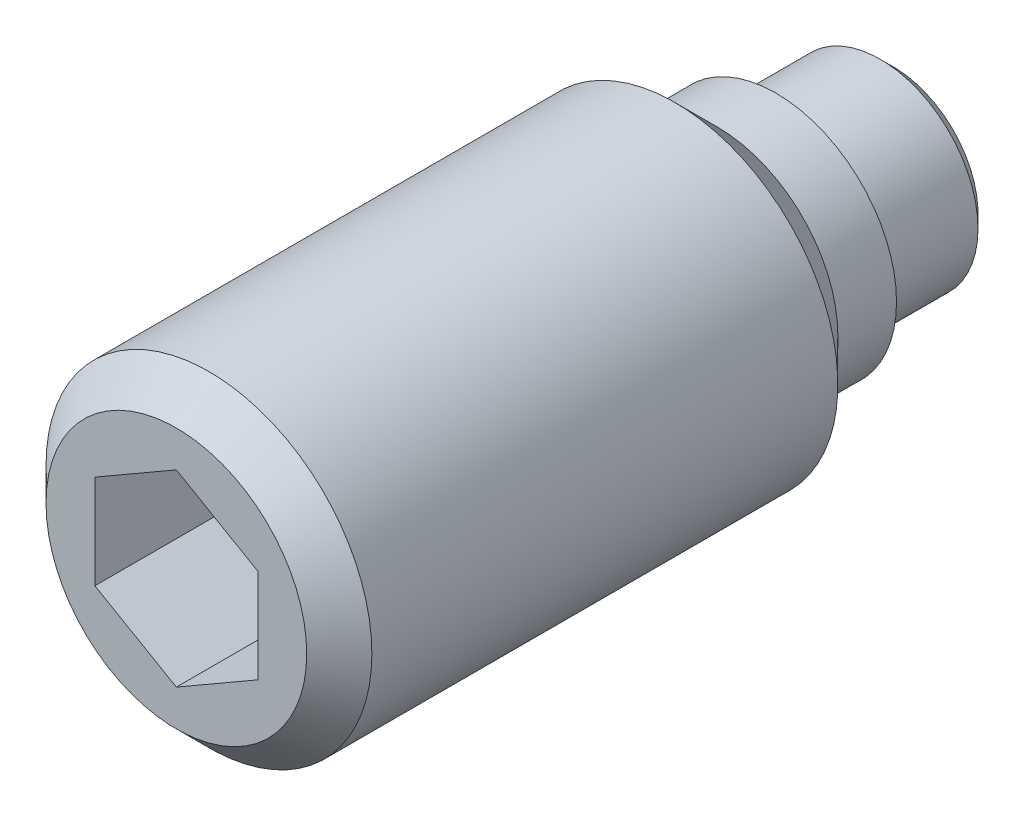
ISO-10303-21;
HEADER;
FILE_DESCRIPTION(('STEP AP214'),'2;1');
FILE_NAME('part.step','',(''),(''),'','','');
FILE_SCHEMA(('AUTOMOTIVE_DESIGN { 1 0 10303 214 1 1 1 1 }'));
ENDSEC;
DATA;
#1=APPLICATION_CONTEXT('core data for automotive mechanical design processes');
#2=APPLICATION_PROTOCOL_DEFINITION('international standard','automotive_design',2000,#1);
#3=PRODUCT_CONTEXT('',#1,'mechanical');
#4=PRODUCT('Part','Part','',(#3));
#5=PRODUCT_RELATED_PRODUCT_CATEGORY('part','',(#4));
#6=PRODUCT_DEFINITION_FORMATION('','',#4);
#7=PRODUCT_DEFINITION_CONTEXT('part definition',#1,'design');
#8=PRODUCT_DEFINITION('design','',#6,#7);
#9=PRODUCT_DEFINITION_SHAPE('','',#8);
#10=(LENGTH_UNIT() NAMED_UNIT(*) SI_UNIT(.MILLI.,.METRE.));
#11=(NAMED_UNIT(*) PLANE_ANGLE_UNIT() SI_UNIT($,.RADIAN.));
#12=(NAMED_UNIT(*) SI_UNIT($,.STERADIAN.) SOLID_ANGLE_UNIT());
#13=UNCERTAINTY_MEASURE_WITH_UNIT(LENGTH_MEASURE(1.E-05),#10,'distance_accuracy_value','');
#14=(GEOMETRIC_REPRESENTATION_CONTEXT(3) GLOBAL_UNCERTAINTY_ASSIGNED_CONTEXT((#13)) GLOBAL_UNIT_ASSIGNED_CONTEXT((#10,
#11,#12)) REPRESENTATION_CONTEXT('',''));
#15=CARTESIAN_POINT('',(0.,0.,0.));
#16=DIRECTION('',(0.,0.,1.));
#17=DIRECTION('',(1.,0.,0.));
#18=AXIS2_PLACEMENT_3D('',#15,#16,#17);
#19=CARTESIAN_POINT('',(0.,0.,1.8));
#20=DIRECTION('',(0.,0.,-1.));
#21=DIRECTION('',(-1.,0.,0.));
#22=AXIS2_PLACEMENT_3D('',#19,#20,#21);
#23=CYLINDRICAL_SURFACE('',#22,2.5);
#24=CARTESIAN_POINT('',(0.,0.,3.35));
#25=DIRECTION('',(0.,0.,-1.));
#26=DIRECTION('',(-1.,0.,0.));
#27=AXIS2_PLACEMENT_3D('',#24,#25,#26);
#28=CIRCLE('',#27,2.5);
#29=CARTESIAN_POINT('',(-2.5,0.,3.35));
#30=VERTEX_POINT('',#29);
#31=EDGE_CURVE('E9',#30,#30,#28,.T.);
#32=ORIENTED_EDGE('',*,*,#31,.F.);
#33=EDGE_LOOP('',(#32));
#34=FACE_BOUND('',#33,.T.);
#35=CARTESIAN_POINT('',(0.,0.,10.5));
#36=DIRECTION('',(0.,0.,1.));
#37=DIRECTION('',(1.,0.,0.));
#38=AXIS2_PLACEMENT_3D('',#35,#36,#37);
#39=CIRCLE('',#38,2.5);
#40=CARTESIAN_POINT('',(2.5,0.,10.5));
#41=VERTEX_POINT('',#40);
#42=EDGE_CURVE('E123',#41,#41,#39,.T.);
#43=ORIENTED_EDGE('',*,*,#42,.F.);
#44=EDGE_LOOP('',(#43));
#45=FACE_BOUND('',#44,.T.);
#46=ADVANCED_FACE('F14',(#34,#45),#23,.T.);
#47=CARTESIAN_POINT('',(0.,0.,3.35));
#48=DIRECTION('',(0.,0.,1.));
#49=DIRECTION('',(1.,0.,0.));
#50=AXIS2_PLACEMENT_3D('',#47,#48,#49);
#51=CONICAL_SURFACE('',#50,2.5,0.785398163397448);
#52=ORIENTED_EDGE('',*,*,#31,.T.);
#53=EDGE_LOOP('',(#52));
#54=FACE_BOUND('',#53,.T.);
#55=CARTESIAN_POINT('',(0.,0.,2.7));
#56=DIRECTION('',(0.,0.,-1.));
#57=DIRECTION('',(-1.,0.,0.));
#58=AXIS2_PLACEMENT_3D('',#55,#56,#57);
#59=CIRCLE('',#58,1.85);
#60=CARTESIAN_POINT('',(-1.85,0.,2.7));
#61=VERTEX_POINT('',#60);
#62=EDGE_CURVE('E21',#61,#61,#59,.T.);
#63=ORIENTED_EDGE('',*,*,#62,.F.);
#64=EDGE_LOOP('',(#63));
#65=FACE_BOUND('',#64,.T.);
#66=ADVANCED_FACE('F143',(#54,#65),#51,.T.);
#67=CARTESIAN_POINT('',(0.,0.,1.8));
#68=DIRECTION('',(0.,0.,-1.));
#69=DIRECTION('',(-1.,0.,0.));
#70=AXIS2_PLACEMENT_3D('',#67,#68,#69);
#71=CYLINDRICAL_SURFACE('',#70,1.85);
#72=ORIENTED_EDGE('',*,*,#62,.T.);
#73=EDGE_LOOP('',(#72));
#74=FACE_BOUND('',#73,.T.);
#75=CARTESIAN_POINT('',(0.,0.,1.8));
#76=DIRECTION('',(0.,0.,-1.));
#77=DIRECTION('',(-1.,0.,0.));
#78=AXIS2_PLACEMENT_3D('',#75,#76,#77);
#79=CIRCLE('',#78,1.85);
#80=CARTESIAN_POINT('',(-1.85,0.,1.8));
#81=VERTEX_POINT('',#80);
#82=EDGE_CURVE('E135',#81,#81,#79,.T.);
#83=ORIENTED_EDGE('',*,*,#82,.F.);
#84=EDGE_LOOP('',(#83));
#85=FACE_BOUND('',#84,.T.);
#86=ADVANCED_FACE('F140',(#74,#85),#71,.T.);
#87=CARTESIAN_POINT('',(0.,1.85,1.8));
#88=DIRECTION('',(0.,0.,1.));
#89=DIRECTION('',(1.,0.,0.));
#90=AXIS2_PLACEMENT_3D('',#87,#88,#89);
#91=PLANE('',#90);
#92=ORIENTED_EDGE('',*,*,#82,.T.);
#93=EDGE_LOOP('',(#92));
#94=FACE_BOUND('',#93,.T.);
#95=CARTESIAN_POINT('',(0.,0.,1.8));
#96=DIRECTION('',(0.,0.,-1.));
#97=DIRECTION('',(-1.,0.,0.));
#98=AXIS2_PLACEMENT_3D('',#95,#96,#97);
#99=CIRCLE('',#98,1.5);
#100=CARTESIAN_POINT('',(-1.5,0.,1.8));
#101=VERTEX_POINT('',#100);
#102=EDGE_CURVE('E132',#101,#101,#99,.T.);
#103=ORIENTED_EDGE('',*,*,#102,.F.);
#104=EDGE_LOOP('',(#103));
#105=FACE_BOUND('',#104,.T.);
#106=ADVANCED_FACE('F151',(#94,#105),#91,.F.);
#107=CARTESIAN_POINT('',(0.,0.,0.));
#108=DIRECTION('',(0.,0.,-1.));
#109=DIRECTION('',(-1.,0.,0.));
#110=AXIS2_PLACEMENT_3D('',#107,#108,#109);
#111=CYLINDRICAL_SURFACE('',#110,1.5);
#112=CARTESIAN_POINT('',(0.,0.,0.2));
#113=DIRECTION('',(0.,0.,-1.));
#114=DIRECTION('',(-1.,0.,0.));
#115=AXIS2_PLACEMENT_3D('',#112,#113,#114);
#116=CIRCLE('',#115,1.5);
#117=CARTESIAN_POINT('',(-1.5,0.,0.2));
#118=VERTEX_POINT('',#117);
#119=EDGE_CURVE('E129',#118,#118,#116,.T.);
#120=ORIENTED_EDGE('',*,*,#119,.F.);
#121=EDGE_LOOP('',(#120));
#122=FACE_BOUND('',#121,.T.);
#123=ORIENTED_EDGE('',*,*,#102,.T.);
#124=EDGE_LOOP('',(#123));
#125=FACE_BOUND('',#124,.T.);
#126=ADVANCED_FACE('F157',(#122,#125),#111,.T.);
#127=CARTESIAN_POINT('',(0.,0.,0.2));
#128=DIRECTION('',(0.,0.,1.));
#129=DIRECTION('',(1.,0.,0.));
#130=AXIS2_PLACEMENT_3D('',#127,#128,#129);
#131=CONICAL_SURFACE('',#130,1.5,0.785398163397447);
#132=CARTESIAN_POINT('',(0.,0.,0.));
#133=DIRECTION('',(0.,0.,-1.));
#134=DIRECTION('',(-1.,0.,0.));
#135=AXIS2_PLACEMENT_3D('',#132,#133,#134);
#136=CIRCLE('',#135,1.3);
#137=CARTESIAN_POINT('',(-1.3,0.,0.));
#138=VERTEX_POINT('',#137);
#139=EDGE_CURVE('E126',#138,#138,#136,.T.);
#140=ORIENTED_EDGE('',*,*,#139,.F.);
#141=EDGE_LOOP('',(#140));
#142=FACE_BOUND('',#141,.T.);
#143=ORIENTED_EDGE('',*,*,#119,.T.);
#144=EDGE_LOOP('',(#143));
#145=FACE_BOUND('',#144,.T.);
#146=ADVANCED_FACE('F161',(#142,#145),#131,.T.);
#147=CARTESIAN_POINT('',(0.,1.3,0.));
#148=DIRECTION('',(0.,0.,1.));
#149=DIRECTION('',(1.,0.,0.));
#150=AXIS2_PLACEMENT_3D('',#147,#148,#149);
#151=PLANE('',#150);
#152=ORIENTED_EDGE('',*,*,#139,.T.);
#153=EDGE_LOOP('',(#152));
#154=FACE_BOUND('',#153,.T.);
#155=ADVANCED_FACE('F165',(#154),#151,.F.);
#156=CARTESIAN_POINT('',(0.,0.,11.));
#157=DIRECTION('',(0.,0.,-1.));
#158=DIRECTION('',(-1.,0.,0.));
#159=AXIS2_PLACEMENT_3D('',#156,#157,#158);
#160=CONICAL_SURFACE('',#159,2.,0.785398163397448);
#161=ORIENTED_EDGE('',*,*,#42,.T.);
#162=EDGE_LOOP('',(#161));
#163=FACE_BOUND('',#162,.T.);
#164=CARTESIAN_POINT('',(0.,0.,11.));
#165=DIRECTION('',(0.,0.,1.));
#166=DIRECTION('',(1.,0.,0.));
#167=AXIS2_PLACEMENT_3D('',#164,#165,#166);
#168=CIRCLE('',#167,2.);
#169=CARTESIAN_POINT('',(2.,0.,11.));
#170=VERTEX_POINT('',#169);
#171=EDGE_CURVE('E115',#170,#170,#168,.T.);
#172=ORIENTED_EDGE('',*,*,#171,.F.);
#173=EDGE_LOOP('',(#172));
#174=FACE_BOUND('',#173,.T.);
#175=ADVANCED_FACE('F169',(#163,#174),#160,.T.);
#176=CARTESIAN_POINT('',(0.,-2.,11.));
#177=DIRECTION('',(0.,0.,1.));
#178=DIRECTION('',(1.,0.,0.));
#179=AXIS2_PLACEMENT_3D('',#176,#177,#178);
#180=PLANE('',#179);
#181=DIRECTION('',(0.866025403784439,-0.5,0.));
#182=VECTOR('',#181,1.);
#183=CARTESIAN_POINT('',(-1.25,-0.721687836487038,11.));
#184=LINE('',#183,#182);
#185=CARTESIAN_POINT('',(-1.25,-0.721687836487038,11.));
#186=VERTEX_POINT('',#185);
#187=CARTESIAN_POINT('',(0.,-1.44337567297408,11.));
#188=VERTEX_POINT('',#187);
#189=EDGE_CURVE('E28',#186,#188,#184,.T.);
#190=ORIENTED_EDGE('',*,*,#189,.F.);
#191=DIRECTION('',(0.,-1.,0.));
#192=VECTOR('',#191,1.);
#193=CARTESIAN_POINT('',(-1.25,0.721687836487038,11.));
#194=LINE('',#193,#192);
#195=CARTESIAN_POINT('',(-1.25,0.721687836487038,11.));
#196=VERTEX_POINT('',#195);
#197=EDGE_CURVE('E111',#196,#186,#194,.T.);
#198=ORIENTED_EDGE('',*,*,#197,.F.);
#199=DIRECTION('',(-0.866025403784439,-0.5,0.));
#200=VECTOR('',#199,1.);
#201=CARTESIAN_POINT('',(0.,1.44337567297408,11.));
#202=LINE('',#201,#200);
#203=CARTESIAN_POINT('',(0.,1.44337567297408,11.));
#204=VERTEX_POINT('',#203);
#205=EDGE_CURVE('E109',#204,#196,#202,.T.);
#206=ORIENTED_EDGE('',*,*,#205,.F.);
#207=DIRECTION('',(-0.866025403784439,0.5,0.));
#208=VECTOR('',#207,1.);
#209=CARTESIAN_POINT('',(1.25,0.721687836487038,11.));
#210=LINE('',#209,#208);
#211=CARTESIAN_POINT('',(1.25,0.721687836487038,11.));
#212=VERTEX_POINT('',#211);
#213=EDGE_CURVE('E76',#212,#204,#210,.T.);
#214=ORIENTED_EDGE('',*,*,#213,.F.);
#215=DIRECTION('',(0.,1.,0.));
#216=VECTOR('',#215,1.);
#217=CARTESIAN_POINT('',(1.25,-0.721687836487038,11.));
#218=LINE('',#217,#216);
#219=CARTESIAN_POINT('',(1.25,-0.721687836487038,11.));
#220=VERTEX_POINT('',#219);
#221=EDGE_CURVE('E105',#220,#212,#218,.T.);
#222=ORIENTED_EDGE('',*,*,#221,.F.);
#223=DIRECTION('',(0.866025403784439,0.5,0.));
#224=VECTOR('',#223,1.);
#225=CARTESIAN_POINT('',(0.,-1.44337567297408,11.));
#226=LINE('',#225,#224);
#227=EDGE_CURVE('E102',#188,#220,#226,.T.);
#228=ORIENTED_EDGE('',*,*,#227,.F.);
#229=EDGE_LOOP('',(#190,#198,#206,#214,#222,#228));
#230=FACE_BOUND('',#229,.T.);
#231=ORIENTED_EDGE('',*,*,#171,.T.);
#232=EDGE_LOOP('',(#231));
#233=FACE_BOUND('',#232,.T.);
#234=ADVANCED_FACE('F173',(#230,#233),#180,.T.);
#235=CARTESIAN_POINT('',(-1.25,-0.721687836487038,8.));
#236=DIRECTION('',(-0.5,-0.866025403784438,0.));
#237=DIRECTION('',(0.866025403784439,-0.5,0.));
#238=AXIS2_PLACEMENT_3D('',#235,#236,#237);
#239=PLANE('',#238);
#240=ORIENTED_EDGE('',*,*,#189,.T.);
#241=DIRECTION('',(0.,0.,1.));
#242=VECTOR('',#241,1.);
#243=CARTESIAN_POINT('',(0.,-1.44337567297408,8.));
#244=LINE('',#243,#242);
#245=CARTESIAN_POINT('',(0.,-1.44337567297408,8.));
#246=VERTEX_POINT('',#245);
#247=EDGE_CURVE('E58',#246,#188,#244,.T.);
#248=ORIENTED_EDGE('',*,*,#247,.F.);
#249=DIRECTION('',(0.866025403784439,-0.5,0.));
#250=VECTOR('',#249,1.);
#251=CARTESIAN_POINT('',(-1.25,-0.721687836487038,8.));
#252=LINE('',#251,#250);
#253=CARTESIAN_POINT('',(-1.25,-0.721687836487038,8.));
#254=VERTEX_POINT('',#253);
#255=EDGE_CURVE('E113',#254,#246,#252,.T.);
#256=ORIENTED_EDGE('',*,*,#255,.F.);
#257=DIRECTION('',(0.,0.,1.));
#258=VECTOR('',#257,1.);
#259=CARTESIAN_POINT('',(-1.25,-0.721687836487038,8.));
#260=LINE('',#259,#258);
#261=EDGE_CURVE('E36',#254,#186,#260,.T.);
#262=ORIENTED_EDGE('',*,*,#261,.T.);
#263=EDGE_LOOP('',(#240,#248,#256,#262));
#264=FACE_BOUND('',#263,.T.);
#265=ADVANCED_FACE('F177',(#264),#239,.F.);
#266=CARTESIAN_POINT('',(-1.25,0.721687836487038,8.));
#267=DIRECTION('',(-1.,0.,0.));
#268=DIRECTION('',(0.,0.,1.));
#269=AXIS2_PLACEMENT_3D('',#266,#267,#268);
#270=PLANE('',#269);
#271=ORIENTED_EDGE('',*,*,#197,.T.);
#272=ORIENTED_EDGE('',*,*,#261,.F.);
#273=DIRECTION('',(0.,-1.,0.));
#274=VECTOR('',#273,1.);
#275=CARTESIAN_POINT('',(-1.25,0.721687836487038,8.));
#276=LINE('',#275,#274);
#277=CARTESIAN_POINT('',(-1.25,0.721687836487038,8.));
#278=VERTEX_POINT('',#277);
#279=EDGE_CURVE('E88',#278,#254,#276,.T.);
#280=ORIENTED_EDGE('',*,*,#279,.F.);
#281=DIRECTION('',(0.,0.,1.));
#282=VECTOR('',#281,1.);
#283=CARTESIAN_POINT('',(-1.25,0.721687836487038,8.));
#284=LINE('',#283,#282);
#285=EDGE_CURVE('E80',#278,#196,#284,.T.);
#286=ORIENTED_EDGE('',*,*,#285,.T.);
#287=EDGE_LOOP('',(#271,#272,#280,#286));
#288=FACE_BOUND('',#287,.T.);
#289=ADVANCED_FACE('F181',(#288),#270,.F.);
#290=CARTESIAN_POINT('',(0.,1.44337567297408,8.));
#291=DIRECTION('',(-0.5,0.866025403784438,0.));
#292=DIRECTION('',(-0.866025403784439,-0.5,0.));
#293=AXIS2_PLACEMENT_3D('',#290,#291,#292);
#294=PLANE('',#293);
#295=ORIENTED_EDGE('',*,*,#205,.T.);
#296=ORIENTED_EDGE('',*,*,#285,.F.);
#297=DIRECTION('',(-0.866025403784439,-0.5,0.));
#298=VECTOR('',#297,1.);
#299=CARTESIAN_POINT('',(0.,1.44337567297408,8.));
#300=LINE('',#299,#298);
#301=CARTESIAN_POINT('',(0.,1.44337567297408,8.));
#302=VERTEX_POINT('',#301);
#303=EDGE_CURVE('E84',#302,#278,#300,.T.);
#304=ORIENTED_EDGE('',*,*,#303,.F.);
#305=DIRECTION('',(0.,0.,1.));
#306=VECTOR('',#305,1.);
#307=CARTESIAN_POINT('',(0.,1.44337567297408,8.));
#308=LINE('',#307,#306);
#309=EDGE_CURVE('E69',#302,#204,#308,.T.);
#310=ORIENTED_EDGE('',*,*,#309,.T.);
#311=EDGE_LOOP('',(#295,#296,#304,#310));
#312=FACE_BOUND('',#311,.T.);
#313=ADVANCED_FACE('F85',(#312),#294,.F.);
#314=CARTESIAN_POINT('',(1.25,0.721687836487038,8.));
#315=DIRECTION('',(0.5,0.866025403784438,0.));
#316=DIRECTION('',(-0.866025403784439,0.5,0.));
#317=AXIS2_PLACEMENT_3D('',#314,#315,#316);
#318=PLANE('',#317);
#319=ORIENTED_EDGE('',*,*,#213,.T.);
#320=ORIENTED_EDGE('',*,*,#309,.F.);
#321=DIRECTION('',(-0.866025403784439,0.5,0.));
#322=VECTOR('',#321,1.);
#323=CARTESIAN_POINT('',(1.25,0.721687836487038,8.));
#324=LINE('',#323,#322);
#325=CARTESIAN_POINT('',(1.25,0.721687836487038,8.));
#326=VERTEX_POINT('',#325);
#327=EDGE_CURVE('E73',#326,#302,#324,.T.);
#328=ORIENTED_EDGE('',*,*,#327,.F.);
#329=DIRECTION('',(0.,0.,1.));
#330=VECTOR('',#329,1.);
#331=CARTESIAN_POINT('',(1.25,0.721687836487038,8.));
#332=LINE('',#331,#330);
#333=EDGE_CURVE('E81',#326,#212,#332,.T.);
#334=ORIENTED_EDGE('',*,*,#333,.T.);
#335=EDGE_LOOP('',(#319,#320,#328,#334));
#336=FACE_BOUND('',#335,.T.);
#337=ADVANCED_FACE('F71',(#336),#318,.F.);
#338=CARTESIAN_POINT('',(1.25,-0.721687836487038,8.));
#339=DIRECTION('',(1.,0.,0.));
#340=DIRECTION('',(0.,0.,-1.));
#341=AXIS2_PLACEMENT_3D('',#338,#339,#340);
#342=PLANE('',#341);
#343=ORIENTED_EDGE('',*,*,#221,.T.);
#344=ORIENTED_EDGE('',*,*,#333,.F.);
#345=DIRECTION('',(0.,1.,0.));
#346=VECTOR('',#345,1.);
#347=CARTESIAN_POINT('',(1.25,-0.721687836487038,8.));
#348=LINE('',#347,#346);
#349=CARTESIAN_POINT('',(1.25,-0.721687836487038,8.));
#350=VERTEX_POINT('',#349);
#351=EDGE_CURVE('E94',#350,#326,#348,.T.);
#352=ORIENTED_EDGE('',*,*,#351,.F.);
#353=DIRECTION('',(0.,0.,1.));
#354=VECTOR('',#353,1.);
#355=CARTESIAN_POINT('',(1.25,-0.721687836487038,8.));
#356=LINE('',#355,#354);
#357=EDGE_CURVE('E118',#350,#220,#356,.T.);
#358=ORIENTED_EDGE('',*,*,#357,.T.);
#359=EDGE_LOOP('',(#343,#344,#352,#358));
#360=FACE_BOUND('',#359,.T.);
#361=ADVANCED_FACE('F185',(#360),#342,.F.);
#362=CARTESIAN_POINT('',(0.,-1.44337567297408,8.));
#363=DIRECTION('',(0.5,-0.866025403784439,0.));
#364=DIRECTION('',(0.866025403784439,0.5,0.));
#365=AXIS2_PLACEMENT_3D('',#362,#363,#364);
#366=PLANE('',#365);
#367=ORIENTED_EDGE('',*,*,#227,.T.);
#368=ORIENTED_EDGE('',*,*,#357,.F.);
#369=DIRECTION('',(0.866025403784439,0.5,0.));
#370=VECTOR('',#369,1.);
#371=CARTESIAN_POINT('',(0.,-1.44337567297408,8.));
#372=LINE('',#371,#370);
#373=EDGE_CURVE('E96',#246,#350,#372,.T.);
#374=ORIENTED_EDGE('',*,*,#373,.F.);
#375=ORIENTED_EDGE('',*,*,#247,.T.);
#376=EDGE_LOOP('',(#367,#368,#374,#375));
#377=FACE_BOUND('',#376,.T.);
#378=ADVANCED_FACE('F182',(#377),#366,.F.);
#379=CARTESIAN_POINT('',(0.,0.,8.));
#380=DIRECTION('',(0.,0.,1.));
#381=DIRECTION('',(1.,0.,0.));
#382=AXIS2_PLACEMENT_3D('',#379,#380,#381);
#383=PLANE('',#382);
#384=ORIENTED_EDGE('',*,*,#255,.T.);
#385=ORIENTED_EDGE('',*,*,#373,.T.);
#386=ORIENTED_EDGE('',*,*,#351,.T.);
#387=ORIENTED_EDGE('',*,*,#327,.T.);
#388=ORIENTED_EDGE('',*,*,#303,.T.);
#389=ORIENTED_EDGE('',*,*,#279,.T.);
#390=EDGE_LOOP('',(#384,#385,#386,#387,#388,#389));
#391=FACE_BOUND('',#390,.T.);
#392=ADVANCED_FACE('F91',(#391),#383,.T.);
#393=CLOSED_SHELL('',(#46,#66,#86,#106,#126,#146,#155,#175,#234,#265,#289,#313,#337,#361,#378,#392));
#394=MANIFOLD_SOLID_BREP('B1',#393);
#395=ADVANCED_BREP_SHAPE_REPRESENTATION('',(#18,#394),#14);
#396=SHAPE_DEFINITION_REPRESENTATION(#9,#395);
ENDSEC;
END-ISO-10303-21;
